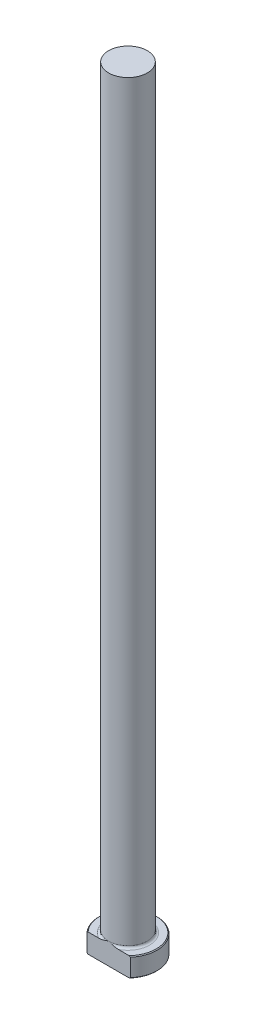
from build123d import *

# Parameters (mm, degrees)
CHAMFER1_SIZE = 0.254
FILLET1_R     = 0.762
KEY_DEPTH     = 255.356936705


with BuildPart() as part:
    # Sketch1 → Revolve1 (revolve)
    with BuildSketch(Plane.XY, mode=Mode.PRIVATE) as revolve1_sk:
        Polygon((0, 0), (-9.525, 0), (-9.525, 6.35), (-6.35, 6.35), (-6.35, 254), (0, 254), align=None)
    revolve(revolve1_sk.sketch.rotate(Axis((0, 259.958771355, 0), (0, -1, 0)), 270), axis=Axis((0, 259.958771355, 0), (0, -1, 0)))

    # Chamfer1
    chamfer1_edges = [part.edges().sort_by_distance(p)[0] for p in [
        (0, 6.35, -9.525),
        (0, 0, -9.525),
    ]]
    chamfer(chamfer1_edges, length=CHAMFER1_SIZE)

    # Fillet1
    fillet1_edges = [part.edges().sort_by_distance(p)[0] for p in [
        (0, 6.35, -6.35),
    ]]
    fillet(fillet1_edges, radius=FILLET1_R)

    # Sketch2 → Key (cut, through all)
    with BuildSketch(Plane(origin=(0, 0, 0), x_dir=(1, 0, 0), z_dir=(0, 1, 0))):
        with BuildLine():
            Line((-7.099515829, -6.35), (7.099515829, -6.35))
            ThreePointArc((7.099515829, -6.35), (0, -9.525), (-7.099515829, -6.35))
        make_face()
    extrude(amount=KEY_DEPTH, mode=Mode.SUBTRACT)


solid = part.part
